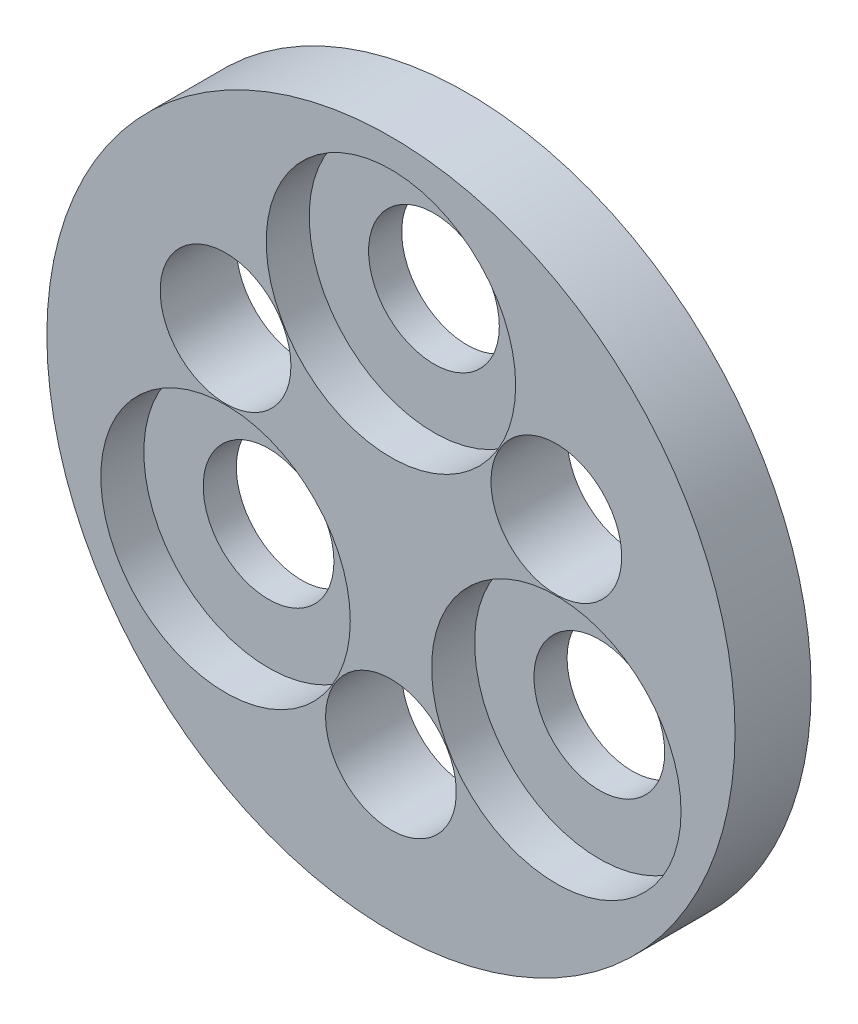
ISO-10303-21;
HEADER;
FILE_DESCRIPTION(('STEP AP214'),'2;1');
FILE_NAME('part.step','',(''),(''),'','','');
FILE_SCHEMA(('AUTOMOTIVE_DESIGN { 1 0 10303 214 1 1 1 1 }'));
ENDSEC;
DATA;
#1=APPLICATION_CONTEXT('core data for automotive mechanical design processes');
#2=APPLICATION_PROTOCOL_DEFINITION('international standard','automotive_design',2000,#1);
#3=PRODUCT_CONTEXT('',#1,'mechanical');
#4=PRODUCT('Part','Part','',(#3));
#5=PRODUCT_RELATED_PRODUCT_CATEGORY('part','',(#4));
#6=PRODUCT_DEFINITION_FORMATION('','',#4);
#7=PRODUCT_DEFINITION_CONTEXT('part definition',#1,'design');
#8=PRODUCT_DEFINITION('design','',#6,#7);
#9=PRODUCT_DEFINITION_SHAPE('','',#8);
#10=(LENGTH_UNIT() NAMED_UNIT(*) SI_UNIT(.MILLI.,.METRE.));
#11=(NAMED_UNIT(*) PLANE_ANGLE_UNIT() SI_UNIT($,.RADIAN.));
#12=(NAMED_UNIT(*) SI_UNIT($,.STERADIAN.) SOLID_ANGLE_UNIT());
#13=UNCERTAINTY_MEASURE_WITH_UNIT(LENGTH_MEASURE(1.E-05),#10,'distance_accuracy_value','');
#14=(GEOMETRIC_REPRESENTATION_CONTEXT(3) GLOBAL_UNCERTAINTY_ASSIGNED_CONTEXT((#13)) GLOBAL_UNIT_ASSIGNED_CONTEXT((#10,
#11,#12)) REPRESENTATION_CONTEXT('',''));
#15=CARTESIAN_POINT('',(0.,0.,0.));
#16=DIRECTION('',(0.,0.,1.));
#17=DIRECTION('',(1.,0.,0.));
#18=AXIS2_PLACEMENT_3D('',#15,#16,#17);
#19=CARTESIAN_POINT('',(0.,0.,-2.24790000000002));
#20=DIRECTION('',(0.,0.,1.));
#21=DIRECTION('',(1.,0.,0.));
#22=AXIS2_PLACEMENT_3D('',#19,#20,#21);
#23=PLANE('',#22);
#24=CARTESIAN_POINT('',(0.,0.,-2.24790000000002));
#25=DIRECTION('',(0.,0.,1.));
#26=DIRECTION('',(1.,0.,0.));
#27=AXIS2_PLACEMENT_3D('',#24,#25,#26);
#28=CIRCLE('',#27,10.16);
#29=CARTESIAN_POINT('',(10.1599999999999,0.,-2.24790000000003));
#30=VERTEX_POINT('',#29);
#31=EDGE_CURVE('E11',#30,#30,#28,.T.);
#32=ORIENTED_EDGE('',*,*,#31,.F.);
#33=EDGE_LOOP('',(#32));
#34=FACE_BOUND('',#33,.T.);
#35=CARTESIAN_POINT('',(-4.88334404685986,2.81939999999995,-2.24790000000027));
#36=DIRECTION('',(0.,0.,1.));
#37=DIRECTION('',(1.,0.,0.));
#38=AXIS2_PLACEMENT_3D('',#35,#36,#37);
#39=CIRCLE('',#38,1.9304);
#40=CARTESIAN_POINT('',(-2.95294404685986,2.81939999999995,-2.24790000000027));
#41=VERTEX_POINT('',#40);
#42=EDGE_CURVE('E165',#41,#41,#39,.T.);
#43=ORIENTED_EDGE('',*,*,#42,.T.);
#44=EDGE_LOOP('',(#43));
#45=FACE_BOUND('',#44,.T.);
#46=CARTESIAN_POINT('',(0.,-5.63880000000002,-2.24790000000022));
#47=DIRECTION('',(0.,0.,1.));
#48=DIRECTION('',(-1.,0.,0.));
#49=AXIS2_PLACEMENT_3D('',#46,#47,#48);
#50=CIRCLE('',#49,1.9304);
#51=CARTESIAN_POINT('',(-1.9304000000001,-5.63880000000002,-2.24790000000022));
#52=VERTEX_POINT('',#51);
#53=EDGE_CURVE('E159',#52,#52,#50,.T.);
#54=ORIENTED_EDGE('',*,*,#53,.T.);
#55=EDGE_LOOP('',(#54));
#56=FACE_BOUND('',#55,.T.);
#57=CARTESIAN_POINT('',(-4.88334404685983,-2.81939999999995,-2.24790000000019));
#58=DIRECTION('',(0.,0.,1.));
#59=DIRECTION('',(1.,0.,0.));
#60=AXIS2_PLACEMENT_3D('',#57,#58,#59);
#61=CIRCLE('',#60,1.9304);
#62=CARTESIAN_POINT('',(-2.95294404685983,-2.81939999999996,-2.24790000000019));
#63=VERTEX_POINT('',#62);
#64=EDGE_CURVE('E153',#63,#63,#61,.T.);
#65=ORIENTED_EDGE('',*,*,#64,.T.);
#66=EDGE_LOOP('',(#65));
#67=FACE_BOUND('',#66,.T.);
#68=CARTESIAN_POINT('',(0.,5.63880000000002,-2.24790000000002));
#69=DIRECTION('',(0.,0.,1.));
#70=DIRECTION('',(1.,0.,0.));
#71=AXIS2_PLACEMENT_3D('',#68,#69,#70);
#72=CIRCLE('',#71,1.9304);
#73=CARTESIAN_POINT('',(1.93039999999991,5.63880000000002,-2.24790000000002));
#74=VERTEX_POINT('',#73);
#75=EDGE_CURVE('E150',#74,#74,#72,.T.);
#76=ORIENTED_EDGE('',*,*,#75,.T.);
#77=EDGE_LOOP('',(#76));
#78=FACE_BOUND('',#77,.T.);
#79=CARTESIAN_POINT('',(4.8833440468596,-2.81939999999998,-2.24790000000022));
#80=DIRECTION('',(0.,0.,1.));
#81=DIRECTION('',(-1.,0.,0.));
#82=AXIS2_PLACEMENT_3D('',#79,#80,#81);
#83=CIRCLE('',#82,1.9304);
#84=CARTESIAN_POINT('',(2.9529440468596,-2.81939999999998,-2.24790000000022));
#85=VERTEX_POINT('',#84);
#86=EDGE_CURVE('E147',#85,#85,#83,.T.);
#87=ORIENTED_EDGE('',*,*,#86,.T.);
#88=EDGE_LOOP('',(#87));
#89=FACE_BOUND('',#88,.T.);
#90=CARTESIAN_POINT('',(4.88334404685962,2.81939999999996,-2.2479));
#91=DIRECTION('',(0.,0.,1.));
#92=DIRECTION('',(-1.,0.,0.));
#93=AXIS2_PLACEMENT_3D('',#90,#91,#92);
#94=CIRCLE('',#93,1.9304);
#95=CARTESIAN_POINT('',(2.95294404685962,2.81939999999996,-2.2479));
#96=VERTEX_POINT('',#95);
#97=EDGE_CURVE('E144',#96,#96,#94,.T.);
#98=ORIENTED_EDGE('',*,*,#97,.T.);
#99=EDGE_LOOP('',(#98));
#100=FACE_BOUND('',#99,.T.);
#101=CARTESIAN_POINT('',(0.,0.,-2.24790000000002));
#102=DIRECTION('',(0.,0.,-1.));
#103=DIRECTION('',(-1.,0.,0.));
#104=AXIS2_PLACEMENT_3D('',#101,#102,#103);
#105=CIRCLE('',#104,2.17649756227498);
#106=CARTESIAN_POINT('',(-2.17649756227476,0.,-2.24790000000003));
#107=VERTEX_POINT('',#106);
#108=EDGE_CURVE('E127',#107,#107,#105,.T.);
#109=ORIENTED_EDGE('',*,*,#108,.F.);
#110=EDGE_LOOP('',(#109));
#111=FACE_BOUND('',#110,.T.);
#112=ADVANCED_FACE('F30',(#34,#45,#56,#67,#78,#89,#100,#111),#23,.F.);
#113=CARTESIAN_POINT('',(4.8833440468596,-2.81939999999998,-2.24790000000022));
#114=DIRECTION('',(0.,0.,1.));
#115=DIRECTION('',(1.,0.,0.));
#116=AXIS2_PLACEMENT_3D('',#113,#114,#115);
#117=CYLINDRICAL_SURFACE('',#116,1.9304);
#118=ORIENTED_EDGE('',*,*,#86,.F.);
#119=EDGE_LOOP('',(#118));
#120=FACE_BOUND('',#119,.T.);
#121=CARTESIAN_POINT('',(4.88334404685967,-2.81939999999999,-1.26999999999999));
#122=DIRECTION('',(0.,0.,1.));
#123=DIRECTION('',(1.,0.,0.));
#124=AXIS2_PLACEMENT_3D('',#121,#122,#123);
#125=CIRCLE('',#124,1.9304);
#126=CARTESIAN_POINT('',(6.81374404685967,-2.81939999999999,-1.26999999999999));
#127=VERTEX_POINT('',#126);
#128=EDGE_CURVE('E34',#127,#127,#125,.F.);
#129=ORIENTED_EDGE('',*,*,#128,.F.);
#130=EDGE_LOOP('',(#129));
#131=FACE_BOUND('',#130,.T.);
#132=ADVANCED_FACE('F55',(#120,#131),#117,.F.);
#133=CARTESIAN_POINT('',(-4.88334404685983,-2.81939999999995,-2.24790000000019));
#134=DIRECTION('',(0.,0.,1.));
#135=DIRECTION('',(1.,0.,0.));
#136=AXIS2_PLACEMENT_3D('',#133,#134,#135);
#137=CYLINDRICAL_SURFACE('',#136,1.9304);
#138=ORIENTED_EDGE('',*,*,#64,.F.);
#139=EDGE_LOOP('',(#138));
#140=FACE_BOUND('',#139,.T.);
#141=CARTESIAN_POINT('',(-4.88334404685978,-2.81939999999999,-1.27000000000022));
#142=DIRECTION('',(0.,0.,1.));
#143=DIRECTION('',(1.,0.,0.));
#144=AXIS2_PLACEMENT_3D('',#141,#142,#143);
#145=CIRCLE('',#144,1.9304);
#146=CARTESIAN_POINT('',(-2.95294404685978,-2.81939999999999,-1.27000000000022));
#147=VERTEX_POINT('',#146);
#148=EDGE_CURVE('E133',#147,#147,#145,.F.);
#149=ORIENTED_EDGE('',*,*,#148,.F.);
#150=EDGE_LOOP('',(#149));
#151=FACE_BOUND('',#150,.T.);
#152=ADVANCED_FACE('F60',(#140,#151),#137,.F.);
#153=CARTESIAN_POINT('',(0.,5.63880000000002,-2.24790000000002));
#154=DIRECTION('',(0.,0.,1.));
#155=DIRECTION('',(1.,0.,0.));
#156=AXIS2_PLACEMENT_3D('',#153,#154,#155);
#157=CYLINDRICAL_SURFACE('',#156,1.9304);
#158=ORIENTED_EDGE('',*,*,#75,.F.);
#159=EDGE_LOOP('',(#158));
#160=FACE_BOUND('',#159,.T.);
#161=CARTESIAN_POINT('',(-1.2490009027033E-13,5.63879999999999,-1.27000000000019));
#162=DIRECTION('',(0.,0.,1.));
#163=DIRECTION('',(1.,0.,0.));
#164=AXIS2_PLACEMENT_3D('',#161,#162,#163);
#165=CIRCLE('',#164,1.9304);
#166=CARTESIAN_POINT('',(1.93039999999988,5.63879999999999,-1.27000000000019));
#167=VERTEX_POINT('',#166);
#168=EDGE_CURVE('E140',#167,#167,#165,.F.);
#169=ORIENTED_EDGE('',*,*,#168,.F.);
#170=EDGE_LOOP('',(#169));
#171=FACE_BOUND('',#170,.T.);
#172=ADVANCED_FACE('F81',(#160,#171),#157,.F.);
#173=CARTESIAN_POINT('',(0.,0.,-2.24790000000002));
#174=DIRECTION('',(0.,0.,1.));
#175=DIRECTION('',(1.,0.,0.));
#176=AXIS2_PLACEMENT_3D('',#173,#174,#175);
#177=CYLINDRICAL_SURFACE('',#176,10.16);
#178=ORIENTED_EDGE('',*,*,#31,.T.);
#179=EDGE_LOOP('',(#178));
#180=FACE_BOUND('',#179,.T.);
#181=CARTESIAN_POINT('',(0.,0.,0.));
#182=DIRECTION('',(0.,0.,1.));
#183=DIRECTION('',(1.,0.,0.));
#184=AXIS2_PLACEMENT_3D('',#181,#182,#183);
#185=CIRCLE('',#184,10.16);
#186=CARTESIAN_POINT('',(10.1599999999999,0.,0.));
#187=VERTEX_POINT('',#186);
#188=EDGE_CURVE('E38',#187,#187,#185,.T.);
#189=ORIENTED_EDGE('',*,*,#188,.F.);
#190=EDGE_LOOP('',(#189));
#191=FACE_BOUND('',#190,.T.);
#192=ADVANCED_FACE('F32',(#180,#191),#177,.T.);
#193=CARTESIAN_POINT('',(0.,0.,0.));
#194=DIRECTION('',(0.,0.,1.));
#195=DIRECTION('',(1.,0.,0.));
#196=AXIS2_PLACEMENT_3D('',#193,#194,#195);
#197=PLANE('',#196);
#198=CARTESIAN_POINT('',(4.88334404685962,-2.81939999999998,-2.4980018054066E-13));
#199=DIRECTION('',(0.,0.,1.));
#200=DIRECTION('',(1.,0.,0.));
#201=AXIS2_PLACEMENT_3D('',#198,#199,#200);
#202=CIRCLE('',#201,3.683);
#203=CARTESIAN_POINT('',(8.56634404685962,-2.81939999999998,-2.50106851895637E-13));
#204=VERTEX_POINT('',#203);
#205=EDGE_CURVE('E124',#204,#204,#202,.T.);
#206=ORIENTED_EDGE('',*,*,#205,.F.);
#207=EDGE_LOOP('',(#206));
#208=FACE_BOUND('',#207,.T.);
#209=CARTESIAN_POINT('',(-4.88334404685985,-2.81939999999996,0.));
#210=DIRECTION('',(0.,0.,1.));
#211=DIRECTION('',(1.,0.,0.));
#212=AXIS2_PLACEMENT_3D('',#209,#210,#211);
#213=CIRCLE('',#212,3.683);
#214=CARTESIAN_POINT('',(-1.20034404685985,-2.81939999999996,0.));
#215=VERTEX_POINT('',#214);
#216=EDGE_CURVE('E120',#215,#215,#213,.T.);
#217=ORIENTED_EDGE('',*,*,#216,.F.);
#218=EDGE_LOOP('',(#217));
#219=FACE_BOUND('',#218,.T.);
#220=CARTESIAN_POINT('',(0.,5.63879999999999,0.));
#221=DIRECTION('',(0.,0.,1.));
#222=DIRECTION('',(1.,0.,0.));
#223=AXIS2_PLACEMENT_3D('',#220,#221,#222);
#224=CIRCLE('',#223,3.683);
#225=CARTESIAN_POINT('',(3.68299999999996,5.63879999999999,0.));
#226=VERTEX_POINT('',#225);
#227=EDGE_CURVE('E134',#226,#226,#224,.T.);
#228=ORIENTED_EDGE('',*,*,#227,.F.);
#229=EDGE_LOOP('',(#228));
#230=FACE_BOUND('',#229,.T.);
#231=CARTESIAN_POINT('',(4.88334404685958,2.81939999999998,-1.10588621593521E-13));
#232=DIRECTION('',(0.,0.,1.));
#233=DIRECTION('',(-1.,0.,0.));
#234=AXIS2_PLACEMENT_3D('',#231,#232,#233);
#235=CIRCLE('',#234,1.9304);
#236=CARTESIAN_POINT('',(2.95294404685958,2.81939999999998,-1.10427883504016E-13));
#237=VERTEX_POINT('',#236);
#238=EDGE_CURVE('E141',#237,#237,#235,.T.);
#239=ORIENTED_EDGE('',*,*,#238,.F.);
#240=EDGE_LOOP('',(#239));
#241=FACE_BOUND('',#240,.T.);
#242=CARTESIAN_POINT('',(0.,-5.63880000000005,-1.94289029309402E-13));
#243=DIRECTION('',(0.,0.,1.));
#244=DIRECTION('',(-1.,0.,0.));
#245=AXIS2_PLACEMENT_3D('',#242,#243,#244);
#246=CIRCLE('',#245,1.9304);
#247=CARTESIAN_POINT('',(-1.93040000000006,-5.63880000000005,-1.94128291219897E-13));
#248=VERTEX_POINT('',#247);
#249=EDGE_CURVE('E156',#248,#248,#246,.T.);
#250=ORIENTED_EDGE('',*,*,#249,.F.);
#251=EDGE_LOOP('',(#250));
#252=FACE_BOUND('',#251,.T.);
#253=CARTESIAN_POINT('',(-4.88334404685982,2.8194,-1.66099772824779E-13));
#254=DIRECTION('',(0.,0.,1.));
#255=DIRECTION('',(1.,0.,0.));
#256=AXIS2_PLACEMENT_3D('',#253,#254,#255);
#257=CIRCLE('',#256,1.9304);
#258=CARTESIAN_POINT('',(-2.95294404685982,2.8194,-1.66260510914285E-13));
#259=VERTEX_POINT('',#258);
#260=EDGE_CURVE('E162',#259,#259,#257,.T.);
#261=ORIENTED_EDGE('',*,*,#260,.F.);
#262=EDGE_LOOP('',(#261));
#263=FACE_BOUND('',#262,.T.);
#264=ORIENTED_EDGE('',*,*,#188,.T.);
#265=EDGE_LOOP('',(#264));
#266=FACE_BOUND('',#265,.T.);
#267=ADVANCED_FACE('F66',(#208,#219,#230,#241,#252,#263,#266),#197,.T.);
#268=CARTESIAN_POINT('',(-4.88334404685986,2.81939999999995,-2.24790000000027));
#269=DIRECTION('',(0.,0.,1.));
#270=DIRECTION('',(1.,0.,0.));
#271=AXIS2_PLACEMENT_3D('',#268,#269,#270);
#272=CYLINDRICAL_SURFACE('',#271,1.9304);
#273=ORIENTED_EDGE('',*,*,#42,.F.);
#274=EDGE_LOOP('',(#273));
#275=FACE_BOUND('',#274,.T.);
#276=ORIENTED_EDGE('',*,*,#260,.T.);
#277=EDGE_LOOP('',(#276));
#278=FACE_BOUND('',#277,.T.);
#279=ADVANCED_FACE('F69',(#275,#278),#272,.F.);
#280=CARTESIAN_POINT('',(0.,-5.63880000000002,-2.24790000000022));
#281=DIRECTION('',(0.,0.,1.));
#282=DIRECTION('',(1.,0.,0.));
#283=AXIS2_PLACEMENT_3D('',#280,#281,#282);
#284=CYLINDRICAL_SURFACE('',#283,1.9304);
#285=ORIENTED_EDGE('',*,*,#53,.F.);
#286=EDGE_LOOP('',(#285));
#287=FACE_BOUND('',#286,.T.);
#288=ORIENTED_EDGE('',*,*,#249,.T.);
#289=EDGE_LOOP('',(#288));
#290=FACE_BOUND('',#289,.T.);
#291=ADVANCED_FACE('F73',(#287,#290),#284,.F.);
#292=CARTESIAN_POINT('',(4.88334404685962,2.81939999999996,-2.2479));
#293=DIRECTION('',(0.,0.,1.));
#294=DIRECTION('',(1.,0.,0.));
#295=AXIS2_PLACEMENT_3D('',#292,#293,#294);
#296=CYLINDRICAL_SURFACE('',#295,1.9304);
#297=ORIENTED_EDGE('',*,*,#97,.F.);
#298=EDGE_LOOP('',(#297));
#299=FACE_BOUND('',#298,.T.);
#300=ORIENTED_EDGE('',*,*,#238,.T.);
#301=EDGE_LOOP('',(#300));
#302=FACE_BOUND('',#301,.T.);
#303=ADVANCED_FACE('F77',(#299,#302),#296,.F.);
#304=CARTESIAN_POINT('',(-1.2490009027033E-13,5.63879999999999,-1.27000000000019));
#305=DIRECTION('',(0.,0.,1.));
#306=DIRECTION('',(1.,0.,0.));
#307=AXIS2_PLACEMENT_3D('',#304,#305,#306);
#308=PLANE('',#307);
#309=CARTESIAN_POINT('',(-1.2490009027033E-13,5.63879999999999,-1.27000000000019));
#310=DIRECTION('',(0.,0.,1.));
#311=DIRECTION('',(1.,0.,0.));
#312=AXIS2_PLACEMENT_3D('',#309,#310,#311);
#313=CIRCLE('',#312,3.683);
#314=CARTESIAN_POINT('',(3.68299999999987,5.63879999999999,-1.27000000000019));
#315=VERTEX_POINT('',#314);
#316=EDGE_CURVE('E137',#315,#315,#313,.T.);
#317=ORIENTED_EDGE('',*,*,#316,.T.);
#318=EDGE_LOOP('',(#317));
#319=FACE_BOUND('',#318,.T.);
#320=ORIENTED_EDGE('',*,*,#168,.T.);
#321=EDGE_LOOP('',(#320));
#322=FACE_BOUND('',#321,.T.);
#323=ADVANCED_FACE('F88',(#319,#322),#308,.T.);
#324=CARTESIAN_POINT('',(-1.2490009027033E-13,5.63879999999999,-1.27000000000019));
#325=DIRECTION('',(0.,0.,1.));
#326=DIRECTION('',(1.,0.,0.));
#327=AXIS2_PLACEMENT_3D('',#324,#325,#326);
#328=CYLINDRICAL_SURFACE('',#327,3.683);
#329=ORIENTED_EDGE('',*,*,#316,.F.);
#330=EDGE_LOOP('',(#329));
#331=FACE_BOUND('',#330,.T.);
#332=ORIENTED_EDGE('',*,*,#227,.T.);
#333=EDGE_LOOP('',(#332));
#334=FACE_BOUND('',#333,.T.);
#335=ADVANCED_FACE('F90',(#331,#334),#328,.F.);
#336=CARTESIAN_POINT('',(-4.88334404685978,-2.81939999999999,-1.27000000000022));
#337=DIRECTION('',(0.,0.,1.));
#338=DIRECTION('',(1.,0.,0.));
#339=AXIS2_PLACEMENT_3D('',#336,#337,#338);
#340=PLANE('',#339);
#341=CARTESIAN_POINT('',(-4.88334404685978,-2.81939999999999,-1.27000000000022));
#342=DIRECTION('',(0.,0.,1.));
#343=DIRECTION('',(1.,0.,0.));
#344=AXIS2_PLACEMENT_3D('',#341,#342,#343);
#345=CIRCLE('',#344,3.683);
#346=CARTESIAN_POINT('',(-1.20034404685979,-2.81939999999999,-1.27000000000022));
#347=VERTEX_POINT('',#346);
#348=EDGE_CURVE('E122',#347,#347,#345,.T.);
#349=ORIENTED_EDGE('',*,*,#348,.T.);
#350=EDGE_LOOP('',(#349));
#351=FACE_BOUND('',#350,.T.);
#352=ORIENTED_EDGE('',*,*,#148,.T.);
#353=EDGE_LOOP('',(#352));
#354=FACE_BOUND('',#353,.T.);
#355=ADVANCED_FACE('F93',(#351,#354),#340,.T.);
#356=CARTESIAN_POINT('',(-4.88334404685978,-2.81939999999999,-1.27000000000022));
#357=DIRECTION('',(0.,0.,1.));
#358=DIRECTION('',(1.,0.,0.));
#359=AXIS2_PLACEMENT_3D('',#356,#357,#358);
#360=CYLINDRICAL_SURFACE('',#359,3.683);
#361=ORIENTED_EDGE('',*,*,#348,.F.);
#362=EDGE_LOOP('',(#361));
#363=FACE_BOUND('',#362,.T.);
#364=ORIENTED_EDGE('',*,*,#216,.T.);
#365=EDGE_LOOP('',(#364));
#366=FACE_BOUND('',#365,.T.);
#367=ADVANCED_FACE('F98',(#363,#366),#360,.F.);
#368=CARTESIAN_POINT('',(4.88334404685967,-2.81939999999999,-1.26999999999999));
#369=DIRECTION('',(0.,0.,1.));
#370=DIRECTION('',(1.,0.,0.));
#371=AXIS2_PLACEMENT_3D('',#368,#369,#370);
#372=PLANE('',#371);
#373=CARTESIAN_POINT('',(4.88334404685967,-2.81939999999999,-1.26999999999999));
#374=DIRECTION('',(0.,0.,1.));
#375=DIRECTION('',(1.,0.,0.));
#376=AXIS2_PLACEMENT_3D('',#373,#374,#375);
#377=CIRCLE('',#376,3.683);
#378=CARTESIAN_POINT('',(8.56634404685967,-2.81939999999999,-1.26999999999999));
#379=VERTEX_POINT('',#378);
#380=EDGE_CURVE('E116',#379,#379,#377,.T.);
#381=ORIENTED_EDGE('',*,*,#380,.T.);
#382=EDGE_LOOP('',(#381));
#383=FACE_BOUND('',#382,.T.);
#384=ORIENTED_EDGE('',*,*,#128,.T.);
#385=EDGE_LOOP('',(#384));
#386=FACE_BOUND('',#385,.T.);
#387=ADVANCED_FACE('F101',(#383,#386),#372,.T.);
#388=CARTESIAN_POINT('',(4.88334404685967,-2.81939999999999,-1.26999999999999));
#389=DIRECTION('',(0.,0.,1.));
#390=DIRECTION('',(1.,0.,0.));
#391=AXIS2_PLACEMENT_3D('',#388,#389,#390);
#392=CYLINDRICAL_SURFACE('',#391,3.683);
#393=ORIENTED_EDGE('',*,*,#380,.F.);
#394=EDGE_LOOP('',(#393));
#395=FACE_BOUND('',#394,.T.);
#396=ORIENTED_EDGE('',*,*,#205,.T.);
#397=EDGE_LOOP('',(#396));
#398=FACE_BOUND('',#397,.T.);
#399=ADVANCED_FACE('F50',(#395,#398),#392,.F.);
#400=CARTESIAN_POINT('',(0.,0.,-0.749260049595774));
#401=DIRECTION('',(0.,0.,-1.));
#402=DIRECTION('',(-1.,0.,0.));
#403=AXIS2_PLACEMENT_3D('',#400,#401,#402);
#404=CONICAL_SURFACE('',#403,0.0362179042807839,0.95993108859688);
#405=CARTESIAN_POINT('',(0.,0.,-0.749260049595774));
#406=DIRECTION('',(0.,0.,-1.));
#407=DIRECTION('',(-1.,0.,0.));
#408=AXIS2_PLACEMENT_3D('',#405,#406,#407);
#409=CIRCLE('',#408,0.0362179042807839);
#410=CARTESIAN_POINT('',(-0.0362179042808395,0.,-0.749260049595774));
#411=VERTEX_POINT('',#410);
#412=EDGE_CURVE('E262',#411,#411,#409,.T.);
#413=CARTESIAN_POINT('',(-2.17649756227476,0.,-2.24790000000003));
#414=CARTESIAN_POINT('',(-2.15420298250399,0.,-2.23228916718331));
#415=CARTESIAN_POINT('',(-2.13190840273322,0.,-2.2166783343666));
#416=CARTESIAN_POINT('',(-2.08731924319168,0.,-2.18545666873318));
#417=CARTESIAN_POINT('',(-2.06502466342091,0.,-2.16984583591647));
#418=CARTESIAN_POINT('',(-2.02043550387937,0.,-2.13862417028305));
#419=CARTESIAN_POINT('',(-1.9981409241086,0.,-2.12301333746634));
#420=CARTESIAN_POINT('',(-1.95355176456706,0.,-2.09179167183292));
#421=CARTESIAN_POINT('',(-1.93125718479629,0.,-2.0761808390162));
#422=CARTESIAN_POINT('',(-1.88666802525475,0.,-2.04495917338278));
#423=CARTESIAN_POINT('',(-1.86437344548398,0.,-2.02934834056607));
#424=CARTESIAN_POINT('',(-1.81978428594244,0.,-1.99812667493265));
#425=CARTESIAN_POINT('',(-1.79748970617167,0.,-1.98251584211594));
#426=CARTESIAN_POINT('',(-1.75290054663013,0.,-1.95129417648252));
#427=CARTESIAN_POINT('',(-1.73060596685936,0.,-1.93568334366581));
#428=CARTESIAN_POINT('',(-1.68601680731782,0.,-1.90446167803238));
#429=CARTESIAN_POINT('',(-1.66372222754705,0.,-1.88885084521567));
#430=CARTESIAN_POINT('',(-1.61913306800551,0.,-1.85762917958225));
#431=CARTESIAN_POINT('',(-1.59683848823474,0.,-1.84201834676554));
#432=CARTESIAN_POINT('',(-1.5522493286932,0.,-1.81079668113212));
#433=CARTESIAN_POINT('',(-1.52995474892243,0.,-1.79518584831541));
#434=CARTESIAN_POINT('',(-1.48536558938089,0.,-1.76396418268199));
#435=CARTESIAN_POINT('',(-1.46307100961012,0.,-1.74835334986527));
#436=CARTESIAN_POINT('',(-1.41848185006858,0.,-1.71713168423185));
#437=CARTESIAN_POINT('',(-1.39618727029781,0.,-1.70152085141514));
#438=CARTESIAN_POINT('',(-1.35159811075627,0.,-1.67029918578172));
#439=CARTESIAN_POINT('',(-1.3293035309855,0.,-1.65468835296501));
#440=CARTESIAN_POINT('',(-1.28471437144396,0.,-1.62346668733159));
#441=CARTESIAN_POINT('',(-1.26241979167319,0.,-1.60785585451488));
#442=CARTESIAN_POINT('',(-1.21783063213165,0.,-1.57663418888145));
#443=CARTESIAN_POINT('',(-1.19553605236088,0.,-1.56102335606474));
#444=CARTESIAN_POINT('',(-1.15094689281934,0.,-1.52980169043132));
#445=CARTESIAN_POINT('',(-1.12865231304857,0.,-1.51419085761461));
#446=CARTESIAN_POINT('',(-1.08406315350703,0.,-1.48296919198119));
#447=CARTESIAN_POINT('',(-1.06176857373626,0.,-1.46735835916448));
#448=CARTESIAN_POINT('',(-1.01717941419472,0.,-1.43613669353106));
#449=CARTESIAN_POINT('',(-0.99488483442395,0.,-1.42052586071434));
#450=CARTESIAN_POINT('',(-0.95029567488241,0.,-1.38930419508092));
#451=CARTESIAN_POINT('',(-0.92800109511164,0.,-1.37369336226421));
#452=CARTESIAN_POINT('',(-0.8834119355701,0.,-1.34247169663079));
#453=CARTESIAN_POINT('',(-0.86111735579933,0.,-1.32686086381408));
#454=CARTESIAN_POINT('',(-0.81652819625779,0.,-1.29563919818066));
#455=CARTESIAN_POINT('',(-0.79423361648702,0.,-1.28002836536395));
#456=CARTESIAN_POINT('',(-0.74964445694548,0.,-1.24880669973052));
#457=CARTESIAN_POINT('',(-0.72734987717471,0.,-1.23319586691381));
#458=CARTESIAN_POINT('',(-0.68276071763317,0.,-1.20197420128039));
#459=CARTESIAN_POINT('',(-0.6604661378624,0.,-1.18636336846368));
#460=CARTESIAN_POINT('',(-0.61587697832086,0.,-1.15514170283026));
#461=CARTESIAN_POINT('',(-0.59358239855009,0.,-1.13953087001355));
#462=CARTESIAN_POINT('',(-0.54899323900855,0.,-1.10830920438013));
#463=CARTESIAN_POINT('',(-0.52669865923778,0.,-1.09269837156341));
#464=CARTESIAN_POINT('',(-0.48210949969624,0.,-1.06147670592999));
#465=CARTESIAN_POINT('',(-0.45981491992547,0.,-1.04586587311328));
#466=CARTESIAN_POINT('',(-0.41522576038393,0.,-1.01464420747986));
#467=CARTESIAN_POINT('',(-0.39293118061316,0.,-0.999033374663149));
#468=CARTESIAN_POINT('',(-0.34834202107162,0.,-0.967811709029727));
#469=CARTESIAN_POINT('',(-0.32604744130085,0.,-0.952200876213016));
#470=CARTESIAN_POINT('',(-0.28145828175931,0.,-0.920979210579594));
#471=CARTESIAN_POINT('',(-0.25916370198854,0.,-0.905368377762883));
#472=CARTESIAN_POINT('',(-0.214574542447,0.,-0.874146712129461));
#473=CARTESIAN_POINT('',(-0.19227996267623,0.,-0.85853587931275));
#474=CARTESIAN_POINT('',(-0.14769080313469,0.,-0.827314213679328));
#475=CARTESIAN_POINT('',(-0.12539622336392,0.,-0.811703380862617));
#476=CARTESIAN_POINT('',(-0.0808070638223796,0.,-0.780481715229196));
#477=CARTESIAN_POINT('',(-0.0585124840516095,0.,-0.764870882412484));
#478=CARTESIAN_POINT('',(-0.0362179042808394,0.,-0.749260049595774));
#479=B_SPLINE_CURVE_WITH_KNOTS('',3,(#413,#414,#415,#416,#417,#418,#419,#420,#421,#422,#423,
#424,#425,#426,#427,#428,#429,#430,#431,#432,#433,#434,#435,#436,#437,#438,#439,#440,#441,#442,
#443,#444,#445,#446,#447,#448,#449,#450,#451,#452,#453,#454,#455,#456,#457,#458,#459,#460,#461,
#462,#463,#464,#465,#466,#467,#468,#469,#470,#471,#472,#473,#474,#475,#476,#477,#478),
.UNSPECIFIED.,.F.,.F.,(4,2,2,2,2,2,2,2,2,2,2,2,2,2,2,2,2,2,2,2,2,2,2,2,2,2,2,2,2,2,2,2,4),(0.,
0.0816499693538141,0.163299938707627,0.244949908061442,0.326599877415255,0.40824984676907,
0.489899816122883,0.571549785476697,0.653199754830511,0.734849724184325,0.816499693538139,
0.898149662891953,0.979799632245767,1.06144960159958,1.14309957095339,1.22474954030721,
1.30639950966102,1.38804947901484,1.46969944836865,1.55134941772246,1.63299938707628,
1.71464935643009,1.79629932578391,1.87794929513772,1.95959926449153,2.04124923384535,
2.12289920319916,2.20454917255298,2.28619914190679,2.3678491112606,2.44949908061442,
2.53114904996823,2.61279901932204),.UNSPECIFIED.);
#480=EDGE_CURVE('BSEAM44',#107,#411,#479,.T.);
#481=ORIENTED_EDGE('',*,*,#108,.T.);
#482=ORIENTED_EDGE('',*,*,#412,.F.);
#483=ORIENTED_EDGE('',*,*,#480,.T.);
#484=ORIENTED_EDGE('',*,*,#480,.F.);
#485=EDGE_LOOP('',(#481,#483,#482,#484));
#486=FACE_BOUND('',#485,.T.);
#487=ADVANCED_FACE('F44',(#486),#404,.F.);
#488=CARTESIAN_POINT('',(-0.00541251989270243,0.,-0.811379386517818));
#489=DIRECTION('',(0.,-1.,0.));
#490=DIRECTION('',(-1.,0.,0.));
#491=AXIS2_PLACEMENT_3D('',#488,#489,#490);
#492=CIRCLE('',#491,0.0693381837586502);
#493=TRIMMED_CURVE('',#492,(PARAMETER_VALUE(-1.64893554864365)),
(PARAMETER_VALUE(1.64893554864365)),.T.,.PARAMETER.);
#494=CARTESIAN_POINT('',(-1.2490009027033E-13,0.,-0.811379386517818));
#495=DIRECTION('',(0.,0.,-1.));
#496=AXIS1_PLACEMENT('',#494,#495);
#497=SURFACE_OF_REVOLUTION('',#493,#496);
#498=ORIENTED_EDGE('',*,*,#412,.T.);
#499=EDGE_LOOP('',(#498));
#500=FACE_BOUND('',#499,.T.);
#501=CARTESIAN_POINT('',(0.,0.,-0.742252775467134));
#502=VERTEX_POINT('',#501);
#503=VERTEX_LOOP('',#502);
#504=FACE_BOUND('',#503,.T.);
#505=ADVANCED_FACE('F42',(#500,#504),#497,.F.);
#506=CLOSED_SHELL('',(#112,#132,#152,#172,#192,#267,#279,#291,#303,#323,#335,#355,#367,#387,
#399,#487,#505));
#507=MANIFOLD_SOLID_BREP('B2',#506);
#508=ADVANCED_BREP_SHAPE_REPRESENTATION('',(#18,#507),#14);
#509=SHAPE_DEFINITION_REPRESENTATION(#9,#508);
ENDSEC;
END-ISO-10303-21;
